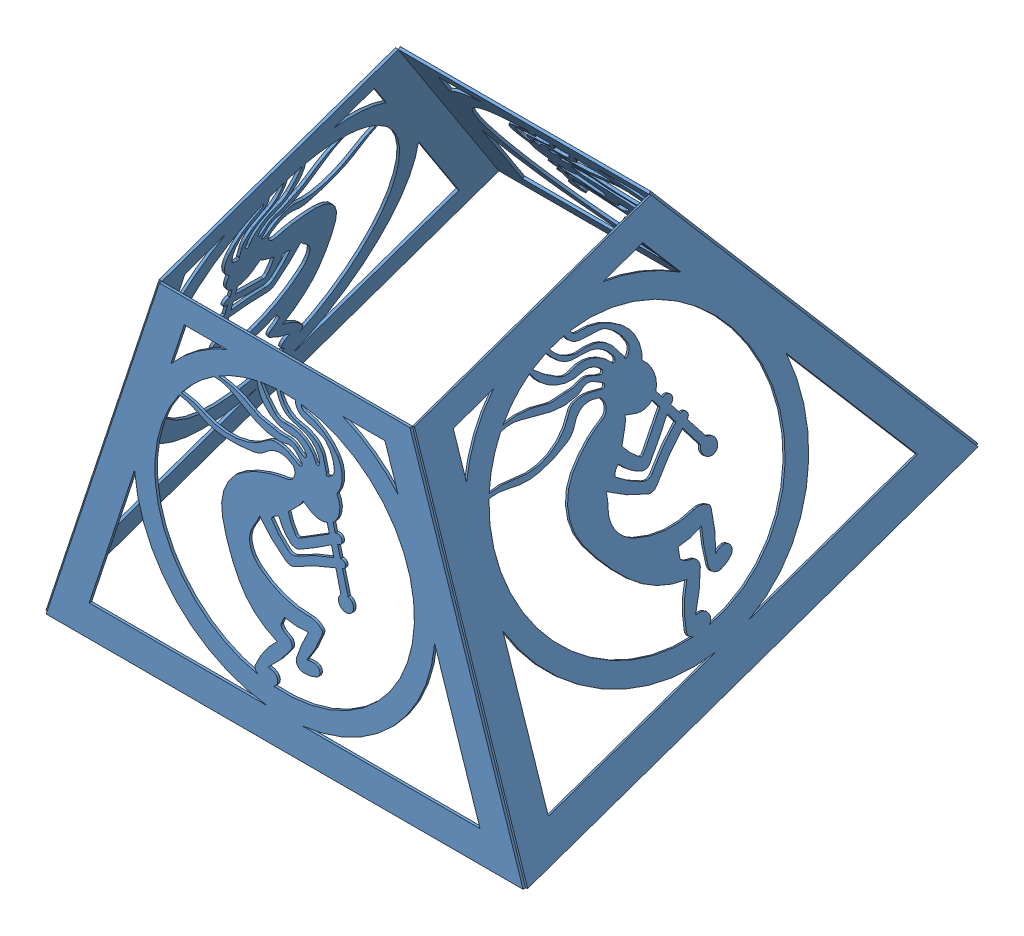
SolidWorks assembly Base1.SLDASM, configuration Default (file format 8000). Lengths in mm.
Overall size (1218.49 1173.84 1415.04).
4 component instances, 1 part files, 6 mates.
Components (placement in the parent):
- Base1-1: Base1.SLDPRT [Default] at (317.5976 867.0186 935.9413) size (1206.5 868.38 6.35)
- Base1-2: Base1.SLDPRT [Default] at (-140.6422 992.5277 576.7294) x (0 -0.329847 0.944034) z (-0.944034 0.311387 0.108799) size (1206.5 868.38 6.35)
- Base1-3: Base1.SLDPRT [Default] at (239.865 1143.6766 144.1352) x (-1 0 0) z (0 0.622773 -0.782402) size (1206.5 868.38 6.35)
- Base1-4: Base1.SLDPRT [Default] at (698.1048 1018.1676 503.3471) x (0 0.329847 -0.944034) z (0.944034 0.311387 0.108799) size (1206.5 868.38 6.35)
Mates (geometry in assembly coordinates):
- Coincident1: coincident aligned: line of Base1-1 through (-324.5187 309.5583 935.9413) axis (0.313246 0.949672 0); line of Base1-2 through (-324.5187 309.5583 935.9413) axis (0.313246 0.949672 0)
- Coincident4: coincident: point of Base1-1; point of Base1-2
- Coincident5: coincident aligned: line of Base1-1 through (881.9813 309.5583 935.9413) axis (-0.313246 0.949672 0); line of Base1-4 through (881.9813 309.5583 935.9413) axis (-0.313246 0.949672 0)
- Perpendicular1: perpendicular: line of Base1-1 through (-324.5187 309.5583 935.9413) axis (1 0 0); line of Base1-4 through (881.9813 309.5583 935.9413) axis (0 0.329847 -0.944034)
- Coincident8: coincident aligned: line of Base1-3 through (881.9813 707.5184 -203.0363) axis (-0.313246 0.743025 0.59143); line of Base1-4 through (881.9813 707.5184 -203.0363) axis (-0.313246 0.743025 0.59143)
- Coincident9: coincident aligned: line of Base1-2 through (-324.5187 707.5184 -203.0363) axis (0.313246 0.743025 0.59143); line of Base1-3 through (-324.5187 707.5184 -203.0363) axis (0.313246 0.743025 0.59143)
